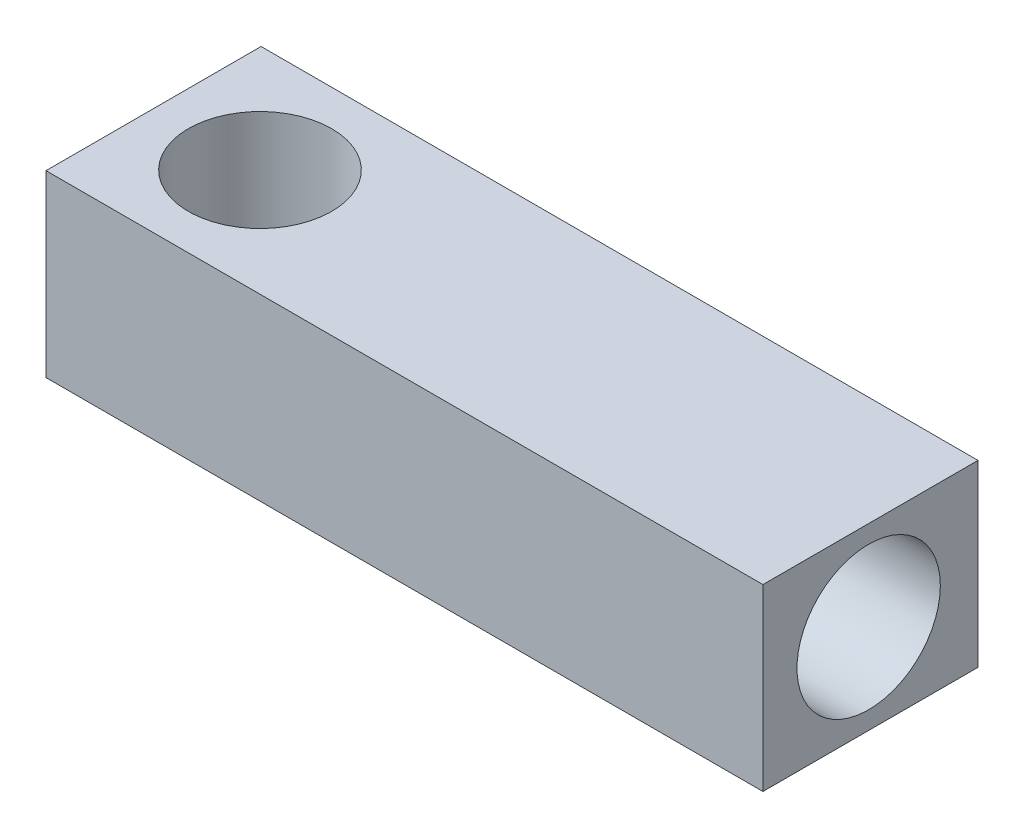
from build123d import *

# Parameters (mm, degrees)
SKETCH1_W           = 100
SKETCH1_H           = 25
BOSS_EXTRUDE2_DEPTH = 30
SKETCH4_R           = 10
CUT_EXTRUDE1_DEPTH  = 55
SKETCH5_R           = 10
CUT_EXTRUDE2_DEPTH  = 55


with BuildPart() as part:
    # Sketch1 → Boss-Extrude2 (new body)
    with BuildSketch(Plane.XY):
        with Locations((-10.793584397, -3.269591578)):
            Rectangle(SKETCH1_W, SKETCH1_H)
    extrude(amount=BOSS_EXTRUDE2_DEPTH)

    # Sketch4 → Cut-Extrude1 (cut)
    with BuildSketch(Plane(origin=(39.206415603, 0, 0), x_dir=(0, 0, -1), z_dir=(1, 0, 0))):
        with Locations((-15.251802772, -3.269591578)):
            Circle(SKETCH4_R)
    extrude(amount=-CUT_EXTRUDE1_DEPTH, mode=Mode.SUBTRACT)

    # Sketch5 → Cut-Extrude2 (cut)
    with BuildSketch(Plane.XZ.offset(15.769591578)):
        with Locations(Location((-45.943139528, 15, 0), (0, 0, 270))):
            Circle(SKETCH5_R)
    extrude(amount=-CUT_EXTRUDE2_DEPTH, mode=Mode.SUBTRACT)


solid = part.part
